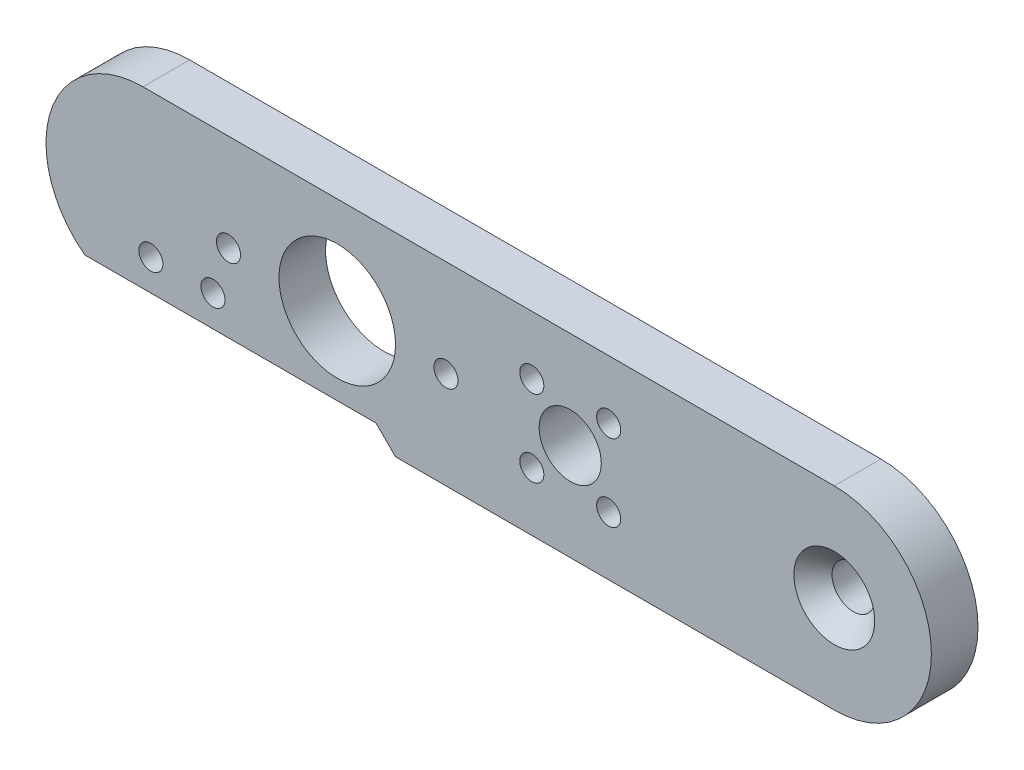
ISO-10303-21;
HEADER;
FILE_DESCRIPTION(('STEP AP214'),'2;1');
FILE_NAME('part.step','',(''),(''),'','','');
FILE_SCHEMA(('AUTOMOTIVE_DESIGN { 1 0 10303 214 1 1 1 1 }'));
ENDSEC;
DATA;
#1=APPLICATION_CONTEXT('core data for automotive mechanical design processes');
#2=APPLICATION_PROTOCOL_DEFINITION('international standard','automotive_design',2000,#1);
#3=PRODUCT_CONTEXT('',#1,'mechanical');
#4=PRODUCT('Part','Part','',(#3));
#5=PRODUCT_RELATED_PRODUCT_CATEGORY('part','',(#4));
#6=PRODUCT_DEFINITION_FORMATION('','',#4);
#7=PRODUCT_DEFINITION_CONTEXT('part definition',#1,'design');
#8=PRODUCT_DEFINITION('design','',#6,#7);
#9=PRODUCT_DEFINITION_SHAPE('','',#8);
#10=(LENGTH_UNIT() NAMED_UNIT(*) SI_UNIT(.MILLI.,.METRE.));
#11=(NAMED_UNIT(*) PLANE_ANGLE_UNIT() SI_UNIT($,.RADIAN.));
#12=(NAMED_UNIT(*) SI_UNIT($,.STERADIAN.) SOLID_ANGLE_UNIT());
#13=UNCERTAINTY_MEASURE_WITH_UNIT(LENGTH_MEASURE(1.E-05),#10,'distance_accuracy_value','');
#14=(GEOMETRIC_REPRESENTATION_CONTEXT(3) GLOBAL_UNCERTAINTY_ASSIGNED_CONTEXT((#13)) GLOBAL_UNIT_ASSIGNED_CONTEXT((#10,
#11,#12)) REPRESENTATION_CONTEXT('',''));
#15=CARTESIAN_POINT('',(0.,0.,0.));
#16=DIRECTION('',(0.,0.,1.));
#17=DIRECTION('',(1.,0.,0.));
#18=AXIS2_PLACEMENT_3D('',#15,#16,#17);
#19=CARTESIAN_POINT('',(44.5,0.,6.));
#20=DIRECTION('',(0.,0.,1.));
#21=DIRECTION('',(1.,0.,0.));
#22=AXIS2_PLACEMENT_3D('',#19,#20,#21);
#23=PLANE('',#22);
#24=CARTESIAN_POINT('',(-35.5,-5.99999999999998,6.));
#25=DIRECTION('',(0.,0.,1.));
#26=DIRECTION('',(1.,0.,0.));
#27=AXIS2_PLACEMENT_3D('',#24,#25,#26);
#28=CIRCLE('',#27,1.55);
#29=CARTESIAN_POINT('',(-33.95,-5.99999999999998,6.));
#30=VERTEX_POINT('',#29);
#31=EDGE_CURVE('E248',#30,#30,#28,.T.);
#32=ORIENTED_EDGE('',*,*,#31,.F.);
#33=EDGE_LOOP('',(#32));
#34=FACE_BOUND('',#33,.T.);
#35=CARTESIAN_POINT('',(-43.5,-5.99999999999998,6.));
#36=DIRECTION('',(0.,0.,1.));
#37=DIRECTION('',(1.,0.,0.));
#38=AXIS2_PLACEMENT_3D('',#35,#36,#37);
#39=CIRCLE('',#38,1.55);
#40=CARTESIAN_POINT('',(-41.95,-5.99999999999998,6.));
#41=VERTEX_POINT('',#40);
#42=EDGE_CURVE('E252',#41,#41,#39,.T.);
#43=ORIENTED_EDGE('',*,*,#42,.F.);
#44=EDGE_LOOP('',(#43));
#45=FACE_BOUND('',#44,.T.);
#46=CARTESIAN_POINT('',(44.5,0.,6.));
#47=DIRECTION('',(0.,0.,1.));
#48=DIRECTION('',(1.,0.,0.));
#49=AXIS2_PLACEMENT_3D('',#46,#47,#48);
#50=CIRCLE('',#49,5.2);
#51=CARTESIAN_POINT('',(49.7,0.,6.));
#52=VERTEX_POINT('',#51);
#53=EDGE_CURVE('E251',#52,#52,#50,.T.);
#54=ORIENTED_EDGE('',*,*,#53,.F.);
#55=EDGE_LOOP('',(#54));
#56=FACE_BOUND('',#55,.T.);
#57=CARTESIAN_POINT('',(-5.5,0.,6.));
#58=DIRECTION('',(0.,0.,1.));
#59=DIRECTION('',(1.,0.,0.));
#60=AXIS2_PLACEMENT_3D('',#57,#58,#59);
#61=CIRCLE('',#60,1.55);
#62=CARTESIAN_POINT('',(-3.95,0.,6.));
#63=VERTEX_POINT('',#62);
#64=EDGE_CURVE('E271',#63,#63,#61,.T.);
#65=ORIENTED_EDGE('',*,*,#64,.F.);
#66=EDGE_LOOP('',(#65));
#67=FACE_BOUND('',#66,.T.);
#68=CARTESIAN_POINT('',(5.55025253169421,-4.94974746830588,6.));
#69=DIRECTION('',(0.,0.,1.));
#70=DIRECTION('',(-1.,0.,0.));
#71=AXIS2_PLACEMENT_3D('',#68,#69,#70);
#72=CIRCLE('',#71,1.55000000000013);
#73=CARTESIAN_POINT('',(4.00025253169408,-4.94974746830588,6.));
#74=VERTEX_POINT('',#73);
#75=EDGE_CURVE('E283',#74,#74,#72,.T.);
#76=ORIENTED_EDGE('',*,*,#75,.F.);
#77=EDGE_LOOP('',(#76));
#78=FACE_BOUND('',#77,.T.);
#79=CARTESIAN_POINT('',(5.55025253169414,4.9497474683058,6.));
#80=DIRECTION('',(0.,0.,1.));
#81=DIRECTION('',(-1.,0.,0.));
#82=AXIS2_PLACEMENT_3D('',#79,#80,#81);
#83=CIRCLE('',#82,1.55);
#84=CARTESIAN_POINT('',(4.00025253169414,4.9497474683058,6.));
#85=VERTEX_POINT('',#84);
#86=EDGE_CURVE('E295',#85,#85,#83,.T.);
#87=ORIENTED_EDGE('',*,*,#86,.F.);
#88=EDGE_LOOP('',(#87));
#89=FACE_BOUND('',#88,.T.);
#90=CARTESIAN_POINT('',(10.5,0.,6.));
#91=DIRECTION('',(0.,0.,1.));
#92=DIRECTION('',(1.,0.,0.));
#93=AXIS2_PLACEMENT_3D('',#90,#91,#92);
#94=CIRCLE('',#93,4.);
#95=CARTESIAN_POINT('',(14.5,0.,6.));
#96=VERTEX_POINT('',#95);
#97=EDGE_CURVE('E122',#96,#96,#94,.T.);
#98=ORIENTED_EDGE('',*,*,#97,.F.);
#99=EDGE_LOOP('',(#98));
#100=FACE_BOUND('',#99,.T.);
#101=CARTESIAN_POINT('',(44.5,0.,6.));
#102=DIRECTION('',(0.,0.,1.));
#103=DIRECTION('',(1.,0.,0.));
#104=AXIS2_PLACEMENT_3D('',#101,#102,#103);
#105=CIRCLE('',#104,12.5);
#106=CARTESIAN_POINT('',(44.5,-12.5,6.));
#107=VERTEX_POINT('',#106);
#108=CARTESIAN_POINT('',(44.5,12.5,6.));
#109=VERTEX_POINT('',#108);
#110=EDGE_CURVE('E129',#107,#109,#105,.T.);
#111=ORIENTED_EDGE('',*,*,#110,.T.);
#112=DIRECTION('',(-1.,0.,0.));
#113=VECTOR('',#112,1.);
#114=CARTESIAN_POINT('',(44.5,12.5,6.));
#115=LINE('',#114,#113);
#116=CARTESIAN_POINT('',(-44.5,12.5,6.));
#117=VERTEX_POINT('',#116);
#118=EDGE_CURVE('E87',#109,#117,#115,.T.);
#119=ORIENTED_EDGE('',*,*,#118,.T.);
#120=CARTESIAN_POINT('',(-44.5,0.,6.));
#121=DIRECTION('',(0.,0.,1.));
#122=DIRECTION('',(1.,0.,0.));
#123=AXIS2_PLACEMENT_3D('',#120,#121,#122);
#124=CIRCLE('',#123,12.5);
#125=CARTESIAN_POINT('',(-52.,-10.,6.));
#126=VERTEX_POINT('',#125);
#127=EDGE_CURVE('E100',#117,#126,#124,.T.);
#128=ORIENTED_EDGE('',*,*,#127,.T.);
#129=DIRECTION('',(1.,0.,0.));
#130=VECTOR('',#129,1.);
#131=CARTESIAN_POINT('',(-52.,-10.,6.));
#132=LINE('',#131,#130);
#133=CARTESIAN_POINT('',(-14.5,-10.,6.));
#134=VERTEX_POINT('',#133);
#135=EDGE_CURVE('E94',#126,#134,#132,.T.);
#136=ORIENTED_EDGE('',*,*,#135,.T.);
#137=DIRECTION('',(0.707106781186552,-0.707106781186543,0.));
#138=VECTOR('',#137,1.);
#139=CARTESIAN_POINT('',(-14.5,-10.,6.));
#140=LINE('',#139,#138);
#141=CARTESIAN_POINT('',(-12.0000000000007,-12.4999999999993,6.));
#142=VERTEX_POINT('',#141);
#143=EDGE_CURVE('E98',#134,#142,#140,.T.);
#144=ORIENTED_EDGE('',*,*,#143,.T.);
#145=DIRECTION('',(1.,0.,0.));
#146=VECTOR('',#145,1.);
#147=CARTESIAN_POINT('',(44.5,-12.5,6.));
#148=LINE('',#147,#146);
#149=EDGE_CURVE('E50',#142,#107,#148,.T.);
#150=ORIENTED_EDGE('',*,*,#149,.T.);
#151=EDGE_LOOP('',(#111,#119,#128,#136,#144,#150));
#152=FACE_BOUND('',#151,.T.);
#153=CARTESIAN_POINT('',(15.4497474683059,4.94974746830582,6.));
#154=DIRECTION('',(0.,0.,1.));
#155=DIRECTION('',(1.,0.,0.));
#156=AXIS2_PLACEMENT_3D('',#153,#154,#155);
#157=CIRCLE('',#156,1.55);
#158=CARTESIAN_POINT('',(16.9997474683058,4.94974746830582,6.));
#159=VERTEX_POINT('',#158);
#160=EDGE_CURVE('E301',#159,#159,#157,.T.);
#161=ORIENTED_EDGE('',*,*,#160,.F.);
#162=EDGE_LOOP('',(#161));
#163=FACE_BOUND('',#162,.T.);
#164=CARTESIAN_POINT('',(15.4497474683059,-4.94974746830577,6.));
#165=DIRECTION('',(0.,0.,1.));
#166=DIRECTION('',(1.,0.,0.));
#167=AXIS2_PLACEMENT_3D('',#164,#165,#166);
#168=CIRCLE('',#167,1.55);
#169=CARTESIAN_POINT('',(16.9997474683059,-4.94974746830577,6.));
#170=VERTEX_POINT('',#169);
#171=EDGE_CURVE('E289',#170,#170,#168,.T.);
#172=ORIENTED_EDGE('',*,*,#171,.F.);
#173=EDGE_LOOP('',(#172));
#174=FACE_BOUND('',#173,.T.);
#175=CARTESIAN_POINT('',(-19.5,0.,6.));
#176=DIRECTION('',(0.,0.,1.));
#177=DIRECTION('',(1.,0.,0.));
#178=AXIS2_PLACEMENT_3D('',#175,#176,#177);
#179=CIRCLE('',#178,7.5);
#180=CARTESIAN_POINT('',(-12.,0.,6.));
#181=VERTEX_POINT('',#180);
#182=EDGE_CURVE('E277',#181,#181,#179,.T.);
#183=ORIENTED_EDGE('',*,*,#182,.F.);
#184=EDGE_LOOP('',(#183));
#185=FACE_BOUND('',#184,.T.);
#186=CARTESIAN_POINT('',(-33.5,0.,6.));
#187=DIRECTION('',(0.,0.,1.));
#188=DIRECTION('',(1.,0.,0.));
#189=AXIS2_PLACEMENT_3D('',#186,#187,#188);
#190=CIRCLE('',#189,1.55);
#191=CARTESIAN_POINT('',(-31.95,0.,6.));
#192=VERTEX_POINT('',#191);
#193=EDGE_CURVE('E265',#192,#192,#190,.T.);
#194=ORIENTED_EDGE('',*,*,#193,.F.);
#195=EDGE_LOOP('',(#194));
#196=FACE_BOUND('',#195,.T.);
#197=ADVANCED_FACE('F33',(#34,#45,#56,#67,#78,#89,#100,#152,#163,#174,#185,#196),#23,.T.);
#198=CARTESIAN_POINT('',(44.5,0.,0.));
#199=DIRECTION('',(0.,0.,1.));
#200=DIRECTION('',(1.,0.,0.));
#201=AXIS2_PLACEMENT_3D('',#198,#199,#200);
#202=PLANE('',#201);
#203=CARTESIAN_POINT('',(-43.5,-5.99999999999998,0.));
#204=DIRECTION('',(0.,0.,1.));
#205=DIRECTION('',(1.,0.,0.));
#206=AXIS2_PLACEMENT_3D('',#203,#204,#205);
#207=CIRCLE('',#206,3.);
#208=CARTESIAN_POINT('',(-40.5,-5.99999999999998,0.));
#209=VERTEX_POINT('',#208);
#210=EDGE_CURVE('E234',#209,#209,#207,.T.);
#211=ORIENTED_EDGE('',*,*,#210,.T.);
#212=EDGE_LOOP('',(#211));
#213=FACE_BOUND('',#212,.T.);
#214=CARTESIAN_POINT('',(-35.5,-5.99999999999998,0.));
#215=DIRECTION('',(0.,0.,1.));
#216=DIRECTION('',(1.,0.,0.));
#217=AXIS2_PLACEMENT_3D('',#214,#215,#216);
#218=CIRCLE('',#217,3.);
#219=CARTESIAN_POINT('',(-32.5,-5.99999999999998,0.));
#220=VERTEX_POINT('',#219);
#221=EDGE_CURVE('E235',#220,#220,#218,.T.);
#222=ORIENTED_EDGE('',*,*,#221,.T.);
#223=EDGE_LOOP('',(#222));
#224=FACE_BOUND('',#223,.T.);
#225=CARTESIAN_POINT('',(44.5,0.,0.));
#226=DIRECTION('',(0.,0.,1.));
#227=DIRECTION('',(1.,0.,0.));
#228=AXIS2_PLACEMENT_3D('',#225,#226,#227);
#229=CIRCLE('',#228,2.75);
#230=CARTESIAN_POINT('',(47.25,0.,0.));
#231=VERTEX_POINT('',#230);
#232=EDGE_CURVE('E261',#231,#231,#229,.T.);
#233=ORIENTED_EDGE('',*,*,#232,.T.);
#234=EDGE_LOOP('',(#233));
#235=FACE_BOUND('',#234,.T.);
#236=CARTESIAN_POINT('',(44.5,0.,0.));
#237=DIRECTION('',(0.,0.,1.));
#238=DIRECTION('',(1.,0.,0.));
#239=AXIS2_PLACEMENT_3D('',#236,#237,#238);
#240=CIRCLE('',#239,12.5);
#241=CARTESIAN_POINT('',(44.5,-12.5,0.));
#242=VERTEX_POINT('',#241);
#243=CARTESIAN_POINT('',(44.5,12.5,0.));
#244=VERTEX_POINT('',#243);
#245=EDGE_CURVE('E118',#242,#244,#240,.T.);
#246=ORIENTED_EDGE('',*,*,#245,.F.);
#247=DIRECTION('',(1.,0.,0.));
#248=VECTOR('',#247,1.);
#249=CARTESIAN_POINT('',(44.5,-12.5,0.));
#250=LINE('',#249,#248);
#251=CARTESIAN_POINT('',(-12.0000000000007,-12.4999999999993,0.));
#252=VERTEX_POINT('',#251);
#253=EDGE_CURVE('E79',#252,#242,#250,.T.);
#254=ORIENTED_EDGE('',*,*,#253,.F.);
#255=DIRECTION('',(0.707106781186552,-0.707106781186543,0.));
#256=VECTOR('',#255,1.);
#257=CARTESIAN_POINT('',(-14.5,-10.,0.));
#258=LINE('',#257,#256);
#259=CARTESIAN_POINT('',(-14.5,-10.,0.));
#260=VERTEX_POINT('',#259);
#261=EDGE_CURVE('E73',#260,#252,#258,.T.);
#262=ORIENTED_EDGE('',*,*,#261,.F.);
#263=DIRECTION('',(1.,0.,0.));
#264=VECTOR('',#263,1.);
#265=CARTESIAN_POINT('',(-52.,-10.,0.));
#266=LINE('',#265,#264);
#267=CARTESIAN_POINT('',(-52.,-10.,0.));
#268=VERTEX_POINT('',#267);
#269=EDGE_CURVE('E108',#268,#260,#266,.T.);
#270=ORIENTED_EDGE('',*,*,#269,.F.);
#271=CARTESIAN_POINT('',(-44.5,0.,0.));
#272=DIRECTION('',(0.,0.,1.));
#273=DIRECTION('',(1.,0.,0.));
#274=AXIS2_PLACEMENT_3D('',#271,#272,#273);
#275=CIRCLE('',#274,12.5);
#276=CARTESIAN_POINT('',(-44.5,12.5,0.));
#277=VERTEX_POINT('',#276);
#278=EDGE_CURVE('E124',#277,#268,#275,.T.);
#279=ORIENTED_EDGE('',*,*,#278,.F.);
#280=DIRECTION('',(-1.,0.,0.));
#281=VECTOR('',#280,1.);
#282=CARTESIAN_POINT('',(44.5,12.5,0.));
#283=LINE('',#282,#281);
#284=EDGE_CURVE('E121',#244,#277,#283,.T.);
#285=ORIENTED_EDGE('',*,*,#284,.F.);
#286=EDGE_LOOP('',(#246,#254,#262,#270,#279,#285));
#287=FACE_BOUND('',#286,.T.);
#288=CARTESIAN_POINT('',(10.5,0.,0.));
#289=DIRECTION('',(0.,0.,1.));
#290=DIRECTION('',(1.,0.,0.));
#291=AXIS2_PLACEMENT_3D('',#288,#289,#290);
#292=CIRCLE('',#291,4.);
#293=CARTESIAN_POINT('',(14.5,0.,0.));
#294=VERTEX_POINT('',#293);
#295=EDGE_CURVE('E304',#294,#294,#292,.T.);
#296=ORIENTED_EDGE('',*,*,#295,.T.);
#297=EDGE_LOOP('',(#296));
#298=FACE_BOUND('',#297,.T.);
#299=CARTESIAN_POINT('',(15.4497474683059,4.94974746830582,0.));
#300=DIRECTION('',(0.,0.,1.));
#301=DIRECTION('',(1.,0.,0.));
#302=AXIS2_PLACEMENT_3D('',#299,#300,#301);
#303=CIRCLE('',#302,1.55);
#304=CARTESIAN_POINT('',(16.9997474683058,4.94974746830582,0.));
#305=VERTEX_POINT('',#304);
#306=EDGE_CURVE('E298',#305,#305,#303,.T.);
#307=ORIENTED_EDGE('',*,*,#306,.T.);
#308=EDGE_LOOP('',(#307));
#309=FACE_BOUND('',#308,.T.);
#310=CARTESIAN_POINT('',(5.55025253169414,4.9497474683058,0.));
#311=DIRECTION('',(0.,0.,1.));
#312=DIRECTION('',(-1.,0.,0.));
#313=AXIS2_PLACEMENT_3D('',#310,#311,#312);
#314=CIRCLE('',#313,1.55);
#315=CARTESIAN_POINT('',(4.00025253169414,4.9497474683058,0.));
#316=VERTEX_POINT('',#315);
#317=EDGE_CURVE('E292',#316,#316,#314,.T.);
#318=ORIENTED_EDGE('',*,*,#317,.T.);
#319=EDGE_LOOP('',(#318));
#320=FACE_BOUND('',#319,.T.);
#321=CARTESIAN_POINT('',(15.4497474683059,-4.94974746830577,0.));
#322=DIRECTION('',(0.,0.,1.));
#323=DIRECTION('',(1.,0.,0.));
#324=AXIS2_PLACEMENT_3D('',#321,#322,#323);
#325=CIRCLE('',#324,1.55);
#326=CARTESIAN_POINT('',(16.9997474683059,-4.94974746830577,0.));
#327=VERTEX_POINT('',#326);
#328=EDGE_CURVE('E286',#327,#327,#325,.T.);
#329=ORIENTED_EDGE('',*,*,#328,.T.);
#330=EDGE_LOOP('',(#329));
#331=FACE_BOUND('',#330,.T.);
#332=CARTESIAN_POINT('',(5.55025253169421,-4.94974746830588,0.));
#333=DIRECTION('',(0.,0.,1.));
#334=DIRECTION('',(-1.,0.,0.));
#335=AXIS2_PLACEMENT_3D('',#332,#333,#334);
#336=CIRCLE('',#335,1.55000000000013);
#337=CARTESIAN_POINT('',(4.00025253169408,-4.94974746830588,0.));
#338=VERTEX_POINT('',#337);
#339=EDGE_CURVE('E280',#338,#338,#336,.T.);
#340=ORIENTED_EDGE('',*,*,#339,.T.);
#341=EDGE_LOOP('',(#340));
#342=FACE_BOUND('',#341,.T.);
#343=CARTESIAN_POINT('',(-19.5,0.,0.));
#344=DIRECTION('',(0.,0.,1.));
#345=DIRECTION('',(1.,0.,0.));
#346=AXIS2_PLACEMENT_3D('',#343,#344,#345);
#347=CIRCLE('',#346,7.5);
#348=CARTESIAN_POINT('',(-12.,0.,0.));
#349=VERTEX_POINT('',#348);
#350=EDGE_CURVE('E274',#349,#349,#347,.T.);
#351=ORIENTED_EDGE('',*,*,#350,.T.);
#352=EDGE_LOOP('',(#351));
#353=FACE_BOUND('',#352,.T.);
#354=CARTESIAN_POINT('',(-5.5,0.,0.));
#355=DIRECTION('',(0.,0.,1.));
#356=DIRECTION('',(1.,0.,0.));
#357=AXIS2_PLACEMENT_3D('',#354,#355,#356);
#358=CIRCLE('',#357,1.55);
#359=CARTESIAN_POINT('',(-3.95,0.,0.));
#360=VERTEX_POINT('',#359);
#361=EDGE_CURVE('E268',#360,#360,#358,.T.);
#362=ORIENTED_EDGE('',*,*,#361,.T.);
#363=EDGE_LOOP('',(#362));
#364=FACE_BOUND('',#363,.T.);
#365=CARTESIAN_POINT('',(-33.5,0.,0.));
#366=DIRECTION('',(0.,0.,1.));
#367=DIRECTION('',(1.,0.,0.));
#368=AXIS2_PLACEMENT_3D('',#365,#366,#367);
#369=CIRCLE('',#368,1.55);
#370=CARTESIAN_POINT('',(-31.95,0.,0.));
#371=VERTEX_POINT('',#370);
#372=EDGE_CURVE('E264',#371,#371,#369,.T.);
#373=ORIENTED_EDGE('',*,*,#372,.T.);
#374=EDGE_LOOP('',(#373));
#375=FACE_BOUND('',#374,.T.);
#376=ADVANCED_FACE('F138',(#213,#224,#235,#287,#298,#309,#320,#331,#342,#353,#364,#375),#202,.F.);
#377=CARTESIAN_POINT('',(44.5,0.,6.));
#378=DIRECTION('',(0.,0.,-1.));
#379=DIRECTION('',(-1.,0.,0.));
#380=AXIS2_PLACEMENT_3D('',#377,#378,#379);
#381=CYLINDRICAL_SURFACE('',#380,12.5);
#382=ORIENTED_EDGE('',*,*,#245,.T.);
#383=DIRECTION('',(0.,0.,-1.));
#384=VECTOR('',#383,1.);
#385=CARTESIAN_POINT('',(44.5,12.5,6.));
#386=LINE('',#385,#384);
#387=EDGE_CURVE('E11',#109,#244,#386,.T.);
#388=ORIENTED_EDGE('',*,*,#387,.F.);
#389=ORIENTED_EDGE('',*,*,#110,.F.);
#390=DIRECTION('',(0.,0.,-1.));
#391=VECTOR('',#390,1.);
#392=CARTESIAN_POINT('',(44.5,-12.5,6.));
#393=LINE('',#392,#391);
#394=EDGE_CURVE('E114',#107,#242,#393,.T.);
#395=ORIENTED_EDGE('',*,*,#394,.T.);
#396=EDGE_LOOP('',(#382,#388,#389,#395));
#397=FACE_BOUND('',#396,.T.);
#398=ADVANCED_FACE('F35',(#397),#381,.T.);
#399=CARTESIAN_POINT('',(44.5,12.5,6.));
#400=DIRECTION('',(0.,-1.,0.));
#401=DIRECTION('',(1.,0.,0.));
#402=AXIS2_PLACEMENT_3D('',#399,#400,#401);
#403=PLANE('',#402);
#404=ORIENTED_EDGE('',*,*,#284,.T.);
#405=DIRECTION('',(0.,0.,-1.));
#406=VECTOR('',#405,1.);
#407=CARTESIAN_POINT('',(-44.5,12.5,6.));
#408=LINE('',#407,#406);
#409=EDGE_CURVE('E42',#117,#277,#408,.T.);
#410=ORIENTED_EDGE('',*,*,#409,.F.);
#411=ORIENTED_EDGE('',*,*,#118,.F.);
#412=ORIENTED_EDGE('',*,*,#387,.T.);
#413=EDGE_LOOP('',(#404,#410,#411,#412));
#414=FACE_BOUND('',#413,.T.);
#415=ADVANCED_FACE('F455',(#414),#403,.F.);
#416=CARTESIAN_POINT('',(-44.5,0.,6.));
#417=DIRECTION('',(0.,0.,-1.));
#418=DIRECTION('',(-1.,0.,0.));
#419=AXIS2_PLACEMENT_3D('',#416,#417,#418);
#420=CYLINDRICAL_SURFACE('',#419,12.5);
#421=ORIENTED_EDGE('',*,*,#278,.T.);
#422=DIRECTION('',(0.,0.,-1.));
#423=VECTOR('',#422,1.);
#424=CARTESIAN_POINT('',(-52.,-10.,6.));
#425=LINE('',#424,#423);
#426=EDGE_CURVE('E109',#126,#268,#425,.T.);
#427=ORIENTED_EDGE('',*,*,#426,.F.);
#428=ORIENTED_EDGE('',*,*,#127,.F.);
#429=ORIENTED_EDGE('',*,*,#409,.T.);
#430=EDGE_LOOP('',(#421,#427,#428,#429));
#431=FACE_BOUND('',#430,.T.);
#432=ADVANCED_FACE('F135',(#431),#420,.T.);
#433=CARTESIAN_POINT('',(-52.,-10.,6.));
#434=DIRECTION('',(0.,1.,0.));
#435=DIRECTION('',(0.,0.,1.));
#436=AXIS2_PLACEMENT_3D('',#433,#434,#435);
#437=PLANE('',#436);
#438=ORIENTED_EDGE('',*,*,#269,.T.);
#439=DIRECTION('',(0.,0.,-1.));
#440=VECTOR('',#439,1.);
#441=CARTESIAN_POINT('',(-14.5,-10.,6.));
#442=LINE('',#441,#440);
#443=EDGE_CURVE('E105',#134,#260,#442,.T.);
#444=ORIENTED_EDGE('',*,*,#443,.F.);
#445=ORIENTED_EDGE('',*,*,#135,.F.);
#446=ORIENTED_EDGE('',*,*,#426,.T.);
#447=EDGE_LOOP('',(#438,#444,#445,#446));
#448=FACE_BOUND('',#447,.T.);
#449=ADVANCED_FACE('F106',(#448),#437,.F.);
#450=CARTESIAN_POINT('',(-14.5,-10.,6.));
#451=DIRECTION('',(0.707106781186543,0.707106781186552,0.));
#452=DIRECTION('',(-0.707106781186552,0.707106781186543,0.));
#453=AXIS2_PLACEMENT_3D('',#450,#451,#452);
#454=PLANE('',#453);
#455=ORIENTED_EDGE('',*,*,#261,.T.);
#456=DIRECTION('',(0.,0.,-1.));
#457=VECTOR('',#456,1.);
#458=CARTESIAN_POINT('',(-12.0000000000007,-12.4999999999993,6.));
#459=LINE('',#458,#457);
#460=EDGE_CURVE('E110',#142,#252,#459,.T.);
#461=ORIENTED_EDGE('',*,*,#460,.F.);
#462=ORIENTED_EDGE('',*,*,#143,.F.);
#463=ORIENTED_EDGE('',*,*,#443,.T.);
#464=EDGE_LOOP('',(#455,#461,#462,#463));
#465=FACE_BOUND('',#464,.T.);
#466=ADVANCED_FACE('F112',(#465),#454,.F.);
#467=CARTESIAN_POINT('',(44.5,-12.5,6.));
#468=DIRECTION('',(0.,1.,0.));
#469=DIRECTION('',(-1.,0.,0.));
#470=AXIS2_PLACEMENT_3D('',#467,#468,#469);
#471=PLANE('',#470);
#472=ORIENTED_EDGE('',*,*,#253,.T.);
#473=ORIENTED_EDGE('',*,*,#394,.F.);
#474=ORIENTED_EDGE('',*,*,#149,.F.);
#475=ORIENTED_EDGE('',*,*,#460,.T.);
#476=EDGE_LOOP('',(#472,#473,#474,#475));
#477=FACE_BOUND('',#476,.T.);
#478=ADVANCED_FACE('F143',(#477),#471,.F.);
#479=CARTESIAN_POINT('',(10.5,0.,6.));
#480=DIRECTION('',(0.,0.,-1.));
#481=DIRECTION('',(-1.,0.,0.));
#482=AXIS2_PLACEMENT_3D('',#479,#480,#481);
#483=CYLINDRICAL_SURFACE('',#482,4.);
#484=ORIENTED_EDGE('',*,*,#97,.T.);
#485=EDGE_LOOP('',(#484));
#486=FACE_BOUND('',#485,.T.);
#487=ORIENTED_EDGE('',*,*,#295,.F.);
#488=EDGE_LOOP('',(#487));
#489=FACE_BOUND('',#488,.T.);
#490=ADVANCED_FACE('F145',(#486,#489),#483,.F.);
#491=CARTESIAN_POINT('',(15.4497474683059,4.94974746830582,6.));
#492=DIRECTION('',(0.,0.,-1.));
#493=DIRECTION('',(-1.,0.,0.));
#494=AXIS2_PLACEMENT_3D('',#491,#492,#493);
#495=CYLINDRICAL_SURFACE('',#494,1.55);
#496=ORIENTED_EDGE('',*,*,#160,.T.);
#497=EDGE_LOOP('',(#496));
#498=FACE_BOUND('',#497,.T.);
#499=ORIENTED_EDGE('',*,*,#306,.F.);
#500=EDGE_LOOP('',(#499));
#501=FACE_BOUND('',#500,.T.);
#502=ADVANCED_FACE('F151',(#498,#501),#495,.F.);
#503=CARTESIAN_POINT('',(5.55025253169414,4.9497474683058,6.));
#504=DIRECTION('',(0.,0.,-1.));
#505=DIRECTION('',(-1.,0.,0.));
#506=AXIS2_PLACEMENT_3D('',#503,#504,#505);
#507=CYLINDRICAL_SURFACE('',#506,1.55);
#508=ORIENTED_EDGE('',*,*,#86,.T.);
#509=EDGE_LOOP('',(#508));
#510=FACE_BOUND('',#509,.T.);
#511=ORIENTED_EDGE('',*,*,#317,.F.);
#512=EDGE_LOOP('',(#511));
#513=FACE_BOUND('',#512,.T.);
#514=ADVANCED_FACE('F168',(#510,#513),#507,.F.);
#515=CARTESIAN_POINT('',(15.4497474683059,-4.94974746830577,6.));
#516=DIRECTION('',(0.,0.,-1.));
#517=DIRECTION('',(-1.,0.,0.));
#518=AXIS2_PLACEMENT_3D('',#515,#516,#517);
#519=CYLINDRICAL_SURFACE('',#518,1.55);
#520=ORIENTED_EDGE('',*,*,#171,.T.);
#521=EDGE_LOOP('',(#520));
#522=FACE_BOUND('',#521,.T.);
#523=ORIENTED_EDGE('',*,*,#328,.F.);
#524=EDGE_LOOP('',(#523));
#525=FACE_BOUND('',#524,.T.);
#526=ADVANCED_FACE('F172',(#522,#525),#519,.F.);
#527=CARTESIAN_POINT('',(5.55025253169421,-4.94974746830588,6.));
#528=DIRECTION('',(0.,0.,-1.));
#529=DIRECTION('',(-1.,0.,0.));
#530=AXIS2_PLACEMENT_3D('',#527,#528,#529);
#531=CYLINDRICAL_SURFACE('',#530,1.55000000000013);
#532=ORIENTED_EDGE('',*,*,#75,.T.);
#533=EDGE_LOOP('',(#532));
#534=FACE_BOUND('',#533,.T.);
#535=ORIENTED_EDGE('',*,*,#339,.F.);
#536=EDGE_LOOP('',(#535));
#537=FACE_BOUND('',#536,.T.);
#538=ADVANCED_FACE('F176',(#534,#537),#531,.F.);
#539=CARTESIAN_POINT('',(-19.5,0.,6.));
#540=DIRECTION('',(0.,0.,-1.));
#541=DIRECTION('',(-1.,0.,0.));
#542=AXIS2_PLACEMENT_3D('',#539,#540,#541);
#543=CYLINDRICAL_SURFACE('',#542,7.5);
#544=ORIENTED_EDGE('',*,*,#182,.T.);
#545=EDGE_LOOP('',(#544));
#546=FACE_BOUND('',#545,.T.);
#547=ORIENTED_EDGE('',*,*,#350,.F.);
#548=EDGE_LOOP('',(#547));
#549=FACE_BOUND('',#548,.T.);
#550=ADVANCED_FACE('F180',(#546,#549),#543,.F.);
#551=CARTESIAN_POINT('',(-5.5,0.,6.));
#552=DIRECTION('',(0.,0.,-1.));
#553=DIRECTION('',(-1.,0.,0.));
#554=AXIS2_PLACEMENT_3D('',#551,#552,#553);
#555=CYLINDRICAL_SURFACE('',#554,1.55);
#556=ORIENTED_EDGE('',*,*,#64,.T.);
#557=EDGE_LOOP('',(#556));
#558=FACE_BOUND('',#557,.T.);
#559=ORIENTED_EDGE('',*,*,#361,.F.);
#560=EDGE_LOOP('',(#559));
#561=FACE_BOUND('',#560,.T.);
#562=ADVANCED_FACE('F184',(#558,#561),#555,.F.);
#563=CARTESIAN_POINT('',(-33.5,0.,6.));
#564=DIRECTION('',(0.,0.,-1.));
#565=DIRECTION('',(-1.,0.,0.));
#566=AXIS2_PLACEMENT_3D('',#563,#564,#565);
#567=CYLINDRICAL_SURFACE('',#566,1.55);
#568=ORIENTED_EDGE('',*,*,#193,.T.);
#569=EDGE_LOOP('',(#568));
#570=FACE_BOUND('',#569,.T.);
#571=ORIENTED_EDGE('',*,*,#372,.F.);
#572=EDGE_LOOP('',(#571));
#573=FACE_BOUND('',#572,.T.);
#574=ADVANCED_FACE('F188',(#570,#573),#567,.F.);
#575=CARTESIAN_POINT('',(44.5,0.,6.));
#576=DIRECTION('',(0.,0.,1.));
#577=DIRECTION('',(1.,0.,0.));
#578=AXIS2_PLACEMENT_3D('',#575,#576,#577);
#579=CYLINDRICAL_SURFACE('',#578,2.75);
#580=ORIENTED_EDGE('',*,*,#232,.F.);
#581=EDGE_LOOP('',(#580));
#582=FACE_BOUND('',#581,.T.);
#583=CARTESIAN_POINT('',(44.5,0.,3.55));
#584=DIRECTION('',(0.,0.,1.));
#585=DIRECTION('',(1.,0.,0.));
#586=AXIS2_PLACEMENT_3D('',#583,#584,#585);
#587=CIRCLE('',#586,2.75);
#588=CARTESIAN_POINT('',(47.25,0.,3.55));
#589=VERTEX_POINT('',#588);
#590=EDGE_CURVE('E258',#589,#589,#587,.T.);
#591=ORIENTED_EDGE('',*,*,#590,.T.);
#592=EDGE_LOOP('',(#591));
#593=FACE_BOUND('',#592,.T.);
#594=ADVANCED_FACE('F192',(#582,#593),#579,.F.);
#595=CARTESIAN_POINT('',(44.5,0.,6.));
#596=DIRECTION('',(0.,0.,1.));
#597=DIRECTION('',(1.,0.,0.));
#598=AXIS2_PLACEMENT_3D('',#595,#596,#597);
#599=CONICAL_SURFACE('',#598,5.2,0.785398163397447);
#600=ORIENTED_EDGE('',*,*,#590,.F.);
#601=EDGE_LOOP('',(#600));
#602=FACE_BOUND('',#601,.T.);
#603=ORIENTED_EDGE('',*,*,#53,.T.);
#604=EDGE_LOOP('',(#603));
#605=FACE_BOUND('',#604,.T.);
#606=ADVANCED_FACE('F196',(#602,#605),#599,.F.);
#607=CARTESIAN_POINT('',(-43.5,-5.99999999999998,3.));
#608=DIRECTION('',(0.,0.,1.));
#609=DIRECTION('',(1.,0.,0.));
#610=AXIS2_PLACEMENT_3D('',#607,#608,#609);
#611=CYLINDRICAL_SURFACE('',#610,1.55);
#612=CARTESIAN_POINT('',(-43.5,-5.99999999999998,3.));
#613=DIRECTION('',(0.,0.,1.));
#614=DIRECTION('',(1.,0.,0.));
#615=AXIS2_PLACEMENT_3D('',#612,#613,#614);
#616=CIRCLE('',#615,1.55);
#617=CARTESIAN_POINT('',(-41.95,-5.99999999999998,3.));
#618=VERTEX_POINT('',#617);
#619=EDGE_CURVE('E229',#618,#618,#616,.T.);
#620=ORIENTED_EDGE('',*,*,#619,.F.);
#621=EDGE_LOOP('',(#620));
#622=FACE_BOUND('',#621,.T.);
#623=ORIENTED_EDGE('',*,*,#42,.T.);
#624=EDGE_LOOP('',(#623));
#625=FACE_BOUND('',#624,.T.);
#626=ADVANCED_FACE('F200',(#622,#625),#611,.F.);
#627=CARTESIAN_POINT('',(-35.5,-5.99999999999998,3.));
#628=DIRECTION('',(0.,0.,1.));
#629=DIRECTION('',(1.,0.,0.));
#630=AXIS2_PLACEMENT_3D('',#627,#628,#629);
#631=CYLINDRICAL_SURFACE('',#630,1.55);
#632=CARTESIAN_POINT('',(-35.5,-5.99999999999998,3.));
#633=DIRECTION('',(0.,0.,1.));
#634=DIRECTION('',(1.,0.,0.));
#635=AXIS2_PLACEMENT_3D('',#632,#633,#634);
#636=CIRCLE('',#635,1.55);
#637=CARTESIAN_POINT('',(-33.95,-5.99999999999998,3.));
#638=VERTEX_POINT('',#637);
#639=EDGE_CURVE('E238',#638,#638,#636,.T.);
#640=ORIENTED_EDGE('',*,*,#639,.F.);
#641=EDGE_LOOP('',(#640));
#642=FACE_BOUND('',#641,.T.);
#643=ORIENTED_EDGE('',*,*,#31,.T.);
#644=EDGE_LOOP('',(#643));
#645=FACE_BOUND('',#644,.T.);
#646=ADVANCED_FACE('F204',(#642,#645),#631,.F.);
#647=CARTESIAN_POINT('',(-35.5,-5.99999999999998,0.));
#648=DIRECTION('',(0.,0.,1.));
#649=DIRECTION('',(1.,0.,0.));
#650=AXIS2_PLACEMENT_3D('',#647,#648,#649);
#651=CYLINDRICAL_SURFACE('',#650,3.);
#652=ORIENTED_EDGE('',*,*,#221,.F.);
#653=EDGE_LOOP('',(#652));
#654=FACE_BOUND('',#653,.T.);
#655=CARTESIAN_POINT('',(-35.5,-5.99999999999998,3.));
#656=DIRECTION('',(0.,0.,1.));
#657=DIRECTION('',(1.,0.,0.));
#658=AXIS2_PLACEMENT_3D('',#655,#656,#657);
#659=CIRCLE('',#658,3.);
#660=CARTESIAN_POINT('',(-32.5,-5.99999999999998,3.));
#661=VERTEX_POINT('',#660);
#662=EDGE_CURVE('E241',#661,#661,#659,.T.);
#663=ORIENTED_EDGE('',*,*,#662,.T.);
#664=EDGE_LOOP('',(#663));
#665=FACE_BOUND('',#664,.T.);
#666=ADVANCED_FACE('F208',(#654,#665),#651,.F.);
#667=CARTESIAN_POINT('',(-35.5,-5.99999999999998,3.));
#668=DIRECTION('',(0.,0.,1.));
#669=DIRECTION('',(1.,0.,0.));
#670=AXIS2_PLACEMENT_3D('',#667,#668,#669);
#671=PLANE('',#670);
#672=ORIENTED_EDGE('',*,*,#639,.T.);
#673=EDGE_LOOP('',(#672));
#674=FACE_BOUND('',#673,.T.);
#675=ORIENTED_EDGE('',*,*,#662,.F.);
#676=EDGE_LOOP('',(#675));
#677=FACE_BOUND('',#676,.T.);
#678=ADVANCED_FACE('F212',(#674,#677),#671,.F.);
#679=CARTESIAN_POINT('',(-43.5,-5.99999999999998,0.));
#680=DIRECTION('',(0.,0.,1.));
#681=DIRECTION('',(1.,0.,0.));
#682=AXIS2_PLACEMENT_3D('',#679,#680,#681);
#683=CYLINDRICAL_SURFACE('',#682,3.);
#684=ORIENTED_EDGE('',*,*,#210,.F.);
#685=EDGE_LOOP('',(#684));
#686=FACE_BOUND('',#685,.T.);
#687=CARTESIAN_POINT('',(-43.5,-5.99999999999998,3.));
#688=DIRECTION('',(0.,0.,1.));
#689=DIRECTION('',(1.,0.,0.));
#690=AXIS2_PLACEMENT_3D('',#687,#688,#689);
#691=CIRCLE('',#690,3.);
#692=CARTESIAN_POINT('',(-40.5,-5.99999999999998,3.));
#693=VERTEX_POINT('',#692);
#694=EDGE_CURVE('E232',#693,#693,#691,.T.);
#695=ORIENTED_EDGE('',*,*,#694,.T.);
#696=EDGE_LOOP('',(#695));
#697=FACE_BOUND('',#696,.T.);
#698=ADVANCED_FACE('F216',(#686,#697),#683,.F.);
#699=CARTESIAN_POINT('',(-43.5,-5.99999999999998,3.));
#700=DIRECTION('',(0.,0.,1.));
#701=DIRECTION('',(1.,0.,0.));
#702=AXIS2_PLACEMENT_3D('',#699,#700,#701);
#703=PLANE('',#702);
#704=ORIENTED_EDGE('',*,*,#619,.T.);
#705=EDGE_LOOP('',(#704));
#706=FACE_BOUND('',#705,.T.);
#707=ORIENTED_EDGE('',*,*,#694,.F.);
#708=EDGE_LOOP('',(#707));
#709=FACE_BOUND('',#708,.T.);
#710=ADVANCED_FACE('F220',(#706,#709),#703,.F.);
#711=CLOSED_SHELL('',(#197,#376,#398,#415,#432,#449,#466,#478,#490,#502,#514,#526,#538,#550,
#562,#574,#594,#606,#626,#646,#666,#678,#698,#710));
#712=MANIFOLD_SOLID_BREP('B2',#711);
#713=ADVANCED_BREP_SHAPE_REPRESENTATION('',(#18,#712),#14);
#714=SHAPE_DEFINITION_REPRESENTATION(#9,#713);
ENDSEC;
END-ISO-10303-21;
